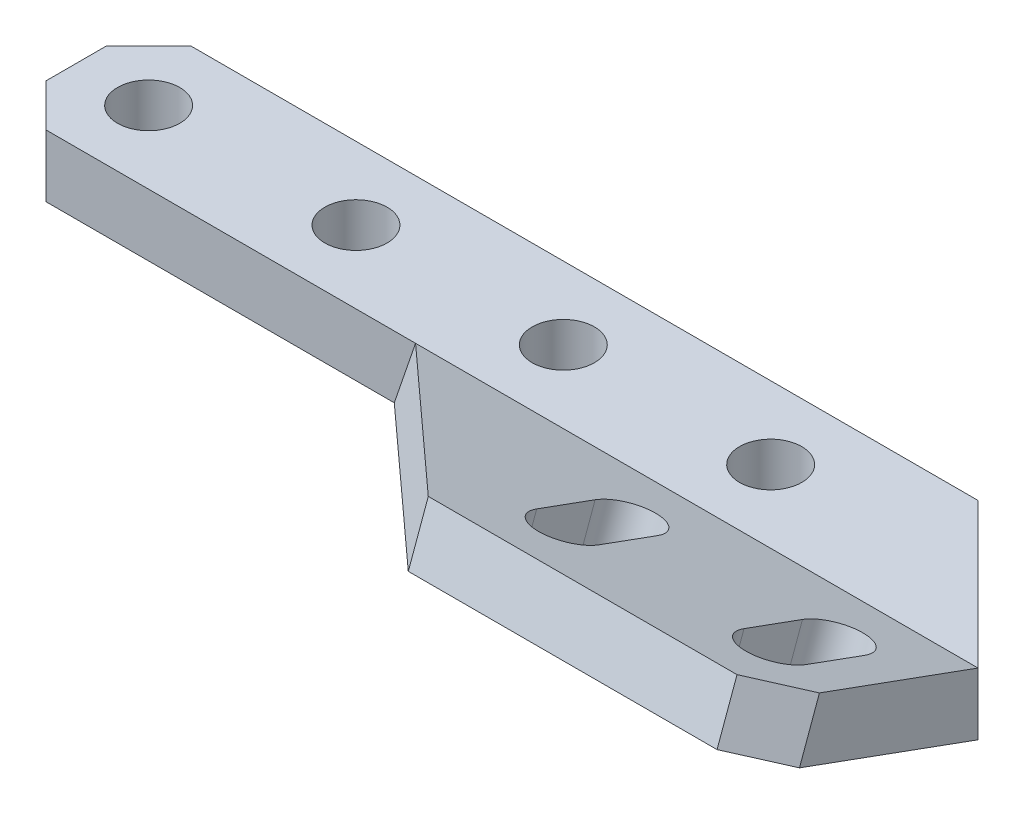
ISO-10303-21;
HEADER;
FILE_DESCRIPTION(('STEP AP214'),'2;1');
FILE_NAME('part.step','',(''),(''),'','','');
FILE_SCHEMA(('AUTOMOTIVE_DESIGN { 1 0 10303 214 1 1 1 1 }'));
ENDSEC;
DATA;
#1=APPLICATION_CONTEXT('core data for automotive mechanical design processes');
#2=APPLICATION_PROTOCOL_DEFINITION('international standard','automotive_design',2000,#1);
#3=PRODUCT_CONTEXT('',#1,'mechanical');
#4=PRODUCT('Part','Part','',(#3));
#5=PRODUCT_RELATED_PRODUCT_CATEGORY('part','',(#4));
#6=PRODUCT_DEFINITION_FORMATION('','',#4);
#7=PRODUCT_DEFINITION_CONTEXT('part definition',#1,'design');
#8=PRODUCT_DEFINITION('design','',#6,#7);
#9=PRODUCT_DEFINITION_SHAPE('','',#8);
#10=(LENGTH_UNIT() NAMED_UNIT(*) SI_UNIT(.MILLI.,.METRE.));
#11=(NAMED_UNIT(*) PLANE_ANGLE_UNIT() SI_UNIT($,.RADIAN.));
#12=(NAMED_UNIT(*) SI_UNIT($,.STERADIAN.) SOLID_ANGLE_UNIT());
#13=UNCERTAINTY_MEASURE_WITH_UNIT(LENGTH_MEASURE(1.E-05),#10,'distance_accuracy_value','');
#14=(GEOMETRIC_REPRESENTATION_CONTEXT(3) GLOBAL_UNCERTAINTY_ASSIGNED_CONTEXT((#13)) GLOBAL_UNIT_ASSIGNED_CONTEXT((#10,
#11,#12)) REPRESENTATION_CONTEXT('',''));
#15=CARTESIAN_POINT('',(0.,0.,0.));
#16=DIRECTION('',(0.,0.,1.));
#17=DIRECTION('',(1.,0.,0.));
#18=AXIS2_PLACEMENT_3D('',#15,#16,#17);
#19=CARTESIAN_POINT('',(13.5,2.64906666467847,2.53581858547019));
#20=DIRECTION('',(-1.,0.,0.));
#21=DIRECTION('',(0.,1.,0.));
#22=AXIS2_PLACEMENT_3D('',#19,#20,#21);
#23=PLANE('',#22);
#24=DIRECTION('',(0.,1.,0.));
#25=VECTOR('',#24,1.);
#26=CARTESIAN_POINT('',(13.5,2.64906666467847,3.5));
#27=LINE('',#26,#25);
#28=CARTESIAN_POINT('',(13.5,0.,3.5));
#29=VERTEX_POINT('',#28);
#30=CARTESIAN_POINT('',(13.5,3.,3.5));
#31=VERTEX_POINT('',#30);
#32=EDGE_CURVE('E189',#29,#31,#27,.T.);
#33=ORIENTED_EDGE('',*,*,#32,.T.);
#34=DIRECTION('',(0.,0.342020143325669,0.939692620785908));
#35=VECTOR('',#34,1.);
#36=CARTESIAN_POINT('',(13.5,2.64906666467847,2.53581858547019));
#37=LINE('',#36,#35);
#38=CARTESIAN_POINT('',(13.5,5.78282944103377,11.1457610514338));
#39=VERTEX_POINT('',#38);
#40=EDGE_CURVE('E264',#31,#39,#37,.T.);
#41=ORIENTED_EDGE('',*,*,#40,.T.);
#42=DIRECTION('',(0.,-0.939692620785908,0.342020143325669));
#43=VECTOR('',#42,1.);
#44=CARTESIAN_POINT('',(13.5,5.78282944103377,11.1457610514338));
#45=LINE('',#44,#43);
#46=CARTESIAN_POINT('',(13.5,3.1337627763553,12.1099424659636));
#47=VERTEX_POINT('',#46);
#48=EDGE_CURVE('E191',#39,#47,#45,.T.);
#49=ORIENTED_EDGE('',*,*,#48,.T.);
#50=DIRECTION('',(0.,0.342020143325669,0.939692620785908));
#51=VECTOR('',#50,1.);
#52=CARTESIAN_POINT('',(13.5,0.,3.5));
#53=LINE('',#52,#51);
#54=EDGE_CURVE('E181',#29,#47,#53,.T.);
#55=ORIENTED_EDGE('',*,*,#54,.F.);
#56=EDGE_LOOP('',(#33,#41,#49,#55));
#57=FACE_BOUND('',#56,.T.);
#58=ADVANCED_FACE('F35',(#57),#23,.F.);
#59=CARTESIAN_POINT('',(13.5,3.,3.5));
#60=DIRECTION('',(0.,0.,-1.));
#61=DIRECTION('',(1.,0.,0.));
#62=AXIS2_PLACEMENT_3D('',#59,#60,#61);
#63=PLANE('',#62);
#64=DIRECTION('',(0.323615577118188,0.946188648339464,0.));
#65=VECTOR('',#64,1.);
#66=CARTESIAN_POINT('',(-10.7857710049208,11.3062228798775,3.5));
#67=LINE('',#66,#65);
#68=CARTESIAN_POINT('',(-14.6527269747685,0.,3.5));
#69=VERTEX_POINT('',#68);
#70=CARTESIAN_POINT('',(-13.6266665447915,3.,3.5));
#71=VERTEX_POINT('',#70);
#72=EDGE_CURVE('E11',#69,#71,#67,.T.);
#73=ORIENTED_EDGE('',*,*,#72,.T.);
#74=DIRECTION('',(-1.,0.,0.));
#75=VECTOR('',#74,1.);
#76=CARTESIAN_POINT('',(13.5,3.,3.5));
#77=LINE('',#76,#75);
#78=CARTESIAN_POINT('',(-31.4497474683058,3.,3.5));
#79=VERTEX_POINT('',#78);
#80=EDGE_CURVE('E174',#71,#79,#77,.T.);
#81=ORIENTED_EDGE('',*,*,#80,.T.);
#82=DIRECTION('',(0.,-1.,0.));
#83=VECTOR('',#82,1.);
#84=CARTESIAN_POINT('',(-31.4497474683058,3.,3.5));
#85=LINE('',#84,#83);
#86=CARTESIAN_POINT('',(-31.4497474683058,0.,3.5));
#87=VERTEX_POINT('',#86);
#88=EDGE_CURVE('E43',#79,#87,#85,.T.);
#89=ORIENTED_EDGE('',*,*,#88,.T.);
#90=DIRECTION('',(-1.,0.,0.));
#91=VECTOR('',#90,1.);
#92=CARTESIAN_POINT('',(13.5,0.,3.5));
#93=LINE('',#92,#91);
#94=EDGE_CURVE('E184',#69,#87,#93,.T.);
#95=ORIENTED_EDGE('',*,*,#94,.F.);
#96=EDGE_LOOP('',(#73,#81,#89,#95));
#97=FACE_BOUND('',#96,.T.);
#98=ADVANCED_FACE('F37',(#97),#63,.F.);
#99=CARTESIAN_POINT('',(0.,3.,0.));
#100=DIRECTION('',(0.,1.,0.));
#101=DIRECTION('',(0.,0.,1.));
#102=AXIS2_PLACEMENT_3D('',#99,#100,#101);
#103=PLANE('',#102);
#104=CARTESIAN_POINT('',(-10.,3.,0.));
#105=DIRECTION('',(0.,-1.,0.));
#106=DIRECTION('',(0.,0.,1.));
#107=AXIS2_PLACEMENT_3D('',#104,#105,#106);
#108=CIRCLE('',#107,1.5);
#109=CARTESIAN_POINT('',(-10.,3.,1.5));
#110=VERTEX_POINT('',#109);
#111=EDGE_CURVE('E289',#110,#110,#108,.T.);
#112=ORIENTED_EDGE('',*,*,#111,.T.);
#113=EDGE_LOOP('',(#112));
#114=FACE_BOUND('',#113,.T.);
#115=CARTESIAN_POINT('',(-30.,3.,0.));
#116=DIRECTION('',(0.,-1.,0.));
#117=DIRECTION('',(0.,0.,1.));
#118=AXIS2_PLACEMENT_3D('',#115,#116,#117);
#119=CIRCLE('',#118,1.5);
#120=CARTESIAN_POINT('',(-30.,3.,1.5));
#121=VERTEX_POINT('',#120);
#122=EDGE_CURVE('E301',#121,#121,#119,.T.);
#123=ORIENTED_EDGE('',*,*,#122,.T.);
#124=EDGE_LOOP('',(#123));
#125=FACE_BOUND('',#124,.T.);
#126=EDGE_CURVE('E306',#31,#71,#77,.T.);
#127=ORIENTED_EDGE('',*,*,#126,.F.);
#128=DIRECTION('',(0.707106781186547,0.,0.707106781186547));
#129=VECTOR('',#128,1.);
#130=CARTESIAN_POINT('',(6.49999999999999,3.,-3.5));
#131=LINE('',#130,#129);
#132=CARTESIAN_POINT('',(6.49999999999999,3.,-3.5));
#133=VERTEX_POINT('',#132);
#134=EDGE_CURVE('E197',#133,#31,#131,.T.);
#135=ORIENTED_EDGE('',*,*,#134,.F.);
#136=DIRECTION('',(1.,0.,0.));
#137=VECTOR('',#136,1.);
#138=CARTESIAN_POINT('',(6.49999999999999,3.,-3.5));
#139=LINE('',#138,#137);
#140=CARTESIAN_POINT('',(-31.4497474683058,3.,-3.5));
#141=VERTEX_POINT('',#140);
#142=EDGE_CURVE('E317',#141,#133,#139,.T.);
#143=ORIENTED_EDGE('',*,*,#142,.F.);
#144=DIRECTION('',(0.707106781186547,0.,-0.707106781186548));
#145=VECTOR('',#144,1.);
#146=CARTESIAN_POINT('',(-33.5,3.,-1.44974746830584));
#147=LINE('',#146,#145);
#148=CARTESIAN_POINT('',(-33.5,3.,-1.44974746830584));
#149=VERTEX_POINT('',#148);
#150=EDGE_CURVE('E314',#149,#141,#147,.T.);
#151=ORIENTED_EDGE('',*,*,#150,.F.);
#152=DIRECTION('',(0.,0.,-1.));
#153=VECTOR('',#152,1.);
#154=CARTESIAN_POINT('',(-33.5,3.,1.44974746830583));
#155=LINE('',#154,#153);
#156=CARTESIAN_POINT('',(-33.5,3.,1.44974746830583));
#157=VERTEX_POINT('',#156);
#158=EDGE_CURVE('E311',#157,#149,#155,.T.);
#159=ORIENTED_EDGE('',*,*,#158,.F.);
#160=DIRECTION('',(-0.707106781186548,0.,-0.707106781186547));
#161=VECTOR('',#160,1.);
#162=CARTESIAN_POINT('',(-31.4497474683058,3.,3.5));
#163=LINE('',#162,#161);
#164=EDGE_CURVE('E308',#79,#157,#163,.T.);
#165=ORIENTED_EDGE('',*,*,#164,.F.);
#166=ORIENTED_EDGE('',*,*,#80,.F.);
#167=EDGE_LOOP('',(#127,#135,#143,#151,#159,#165,#166));
#168=FACE_BOUND('',#167,.T.);
#169=CARTESIAN_POINT('',(-20.,3.,0.));
#170=DIRECTION('',(0.,-1.,0.));
#171=DIRECTION('',(0.,0.,1.));
#172=AXIS2_PLACEMENT_3D('',#169,#170,#171);
#173=CIRCLE('',#172,1.5);
#174=CARTESIAN_POINT('',(-20.,3.,1.5));
#175=VERTEX_POINT('',#174);
#176=EDGE_CURVE('E295',#175,#175,#173,.T.);
#177=ORIENTED_EDGE('',*,*,#176,.T.);
#178=EDGE_LOOP('',(#177));
#179=FACE_BOUND('',#178,.T.);
#180=CARTESIAN_POINT('',(0.,3.,0.));
#181=DIRECTION('',(0.,-1.,0.));
#182=DIRECTION('',(0.,0.,1.));
#183=AXIS2_PLACEMENT_3D('',#180,#181,#182);
#184=CIRCLE('',#183,1.5);
#185=CARTESIAN_POINT('',(0.,3.,1.5));
#186=VERTEX_POINT('',#185);
#187=EDGE_CURVE('E283',#186,#186,#184,.T.);
#188=ORIENTED_EDGE('',*,*,#187,.T.);
#189=EDGE_LOOP('',(#188));
#190=FACE_BOUND('',#189,.T.);
#191=ADVANCED_FACE('F355',(#114,#125,#168,#179,#190),#103,.T.);
#192=CARTESIAN_POINT('',(0.,0.,0.));
#193=DIRECTION('',(0.,1.,0.));
#194=DIRECTION('',(0.,0.,1.));
#195=AXIS2_PLACEMENT_3D('',#192,#193,#194);
#196=PLANE('',#195);
#197=EDGE_CURVE('E167',#29,#69,#93,.T.);
#198=ORIENTED_EDGE('',*,*,#197,.T.);
#199=ORIENTED_EDGE('',*,*,#94,.T.);
#200=DIRECTION('',(-0.707106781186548,0.,-0.707106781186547));
#201=VECTOR('',#200,1.);
#202=CARTESIAN_POINT('',(-31.4497474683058,0.,3.5));
#203=LINE('',#202,#201);
#204=CARTESIAN_POINT('',(-33.5,0.,1.44974746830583));
#205=VERTEX_POINT('',#204);
#206=EDGE_CURVE('E183',#87,#205,#203,.T.);
#207=ORIENTED_EDGE('',*,*,#206,.T.);
#208=DIRECTION('',(0.,0.,-1.));
#209=VECTOR('',#208,1.);
#210=CARTESIAN_POINT('',(-33.5,0.,1.44974746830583));
#211=LINE('',#210,#209);
#212=CARTESIAN_POINT('',(-33.5,0.,-1.44974746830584));
#213=VERTEX_POINT('',#212);
#214=EDGE_CURVE('E324',#205,#213,#211,.T.);
#215=ORIENTED_EDGE('',*,*,#214,.T.);
#216=DIRECTION('',(0.707106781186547,0.,-0.707106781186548));
#217=VECTOR('',#216,1.);
#218=CARTESIAN_POINT('',(-33.5,0.,-1.44974746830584));
#219=LINE('',#218,#217);
#220=CARTESIAN_POINT('',(-31.4497474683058,0.,-3.5));
#221=VERTEX_POINT('',#220);
#222=EDGE_CURVE('E327',#213,#221,#219,.T.);
#223=ORIENTED_EDGE('',*,*,#222,.T.);
#224=DIRECTION('',(1.,0.,0.));
#225=VECTOR('',#224,1.);
#226=CARTESIAN_POINT('',(6.49999999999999,0.,-3.5));
#227=LINE('',#226,#225);
#228=CARTESIAN_POINT('',(6.49999999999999,0.,-3.5));
#229=VERTEX_POINT('',#228);
#230=EDGE_CURVE('E171',#221,#229,#227,.T.);
#231=ORIENTED_EDGE('',*,*,#230,.T.);
#232=DIRECTION('',(0.707106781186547,0.,0.707106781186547));
#233=VECTOR('',#232,1.);
#234=CARTESIAN_POINT('',(6.49999999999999,0.,-3.5));
#235=LINE('',#234,#233);
#236=EDGE_CURVE('E163',#229,#29,#235,.T.);
#237=ORIENTED_EDGE('',*,*,#236,.T.);
#238=EDGE_LOOP('',(#198,#199,#207,#215,#223,#231,#237));
#239=FACE_BOUND('',#238,.T.);
#240=CARTESIAN_POINT('',(-30.,0.,0.));
#241=DIRECTION('',(0.,-1.,0.));
#242=DIRECTION('',(0.,0.,1.));
#243=AXIS2_PLACEMENT_3D('',#240,#241,#242);
#244=CIRCLE('',#243,1.5);
#245=CARTESIAN_POINT('',(-30.,0.,1.5));
#246=VERTEX_POINT('',#245);
#247=EDGE_CURVE('E298',#246,#246,#244,.T.);
#248=ORIENTED_EDGE('',*,*,#247,.F.);
#249=EDGE_LOOP('',(#248));
#250=FACE_BOUND('',#249,.T.);
#251=CARTESIAN_POINT('',(-20.,0.,0.));
#252=DIRECTION('',(0.,-1.,0.));
#253=DIRECTION('',(0.,0.,1.));
#254=AXIS2_PLACEMENT_3D('',#251,#252,#253);
#255=CIRCLE('',#254,1.5);
#256=CARTESIAN_POINT('',(-20.,0.,1.5));
#257=VERTEX_POINT('',#256);
#258=EDGE_CURVE('E292',#257,#257,#255,.T.);
#259=ORIENTED_EDGE('',*,*,#258,.F.);
#260=EDGE_LOOP('',(#259));
#261=FACE_BOUND('',#260,.T.);
#262=CARTESIAN_POINT('',(-10.,0.,0.));
#263=DIRECTION('',(0.,-1.,0.));
#264=DIRECTION('',(0.,0.,1.));
#265=AXIS2_PLACEMENT_3D('',#262,#263,#264);
#266=CIRCLE('',#265,1.5);
#267=CARTESIAN_POINT('',(-10.,0.,1.5));
#268=VERTEX_POINT('',#267);
#269=EDGE_CURVE('E286',#268,#268,#266,.T.);
#270=ORIENTED_EDGE('',*,*,#269,.F.);
#271=EDGE_LOOP('',(#270));
#272=FACE_BOUND('',#271,.T.);
#273=CARTESIAN_POINT('',(0.,0.,0.));
#274=DIRECTION('',(0.,-1.,0.));
#275=DIRECTION('',(0.,0.,1.));
#276=AXIS2_PLACEMENT_3D('',#273,#274,#275);
#277=CIRCLE('',#276,1.5);
#278=CARTESIAN_POINT('',(0.,0.,1.5));
#279=VERTEX_POINT('',#278);
#280=EDGE_CURVE('E282',#279,#279,#277,.T.);
#281=ORIENTED_EDGE('',*,*,#280,.F.);
#282=EDGE_LOOP('',(#281));
#283=FACE_BOUND('',#282,.T.);
#284=ADVANCED_FACE('F164',(#239,#250,#261,#272,#283),#196,.F.);
#285=CARTESIAN_POINT('',(-31.4497474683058,3.,3.5));
#286=DIRECTION('',(0.707106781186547,0.,-0.707106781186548));
#287=DIRECTION('',(0.707106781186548,0.,0.707106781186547));
#288=AXIS2_PLACEMENT_3D('',#285,#286,#287);
#289=PLANE('',#288);
#290=ORIENTED_EDGE('',*,*,#206,.F.);
#291=ORIENTED_EDGE('',*,*,#88,.F.);
#292=ORIENTED_EDGE('',*,*,#164,.T.);
#293=DIRECTION('',(0.,-1.,0.));
#294=VECTOR('',#293,1.);
#295=CARTESIAN_POINT('',(-33.5,3.,1.44974746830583));
#296=LINE('',#295,#294);
#297=EDGE_CURVE('E335',#157,#205,#296,.T.);
#298=ORIENTED_EDGE('',*,*,#297,.T.);
#299=EDGE_LOOP('',(#290,#291,#292,#298));
#300=FACE_BOUND('',#299,.T.);
#301=ADVANCED_FACE('F342',(#300),#289,.F.);
#302=CARTESIAN_POINT('',(-33.5,3.,1.44974746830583));
#303=DIRECTION('',(1.,0.,0.));
#304=DIRECTION('',(0.,0.,1.));
#305=AXIS2_PLACEMENT_3D('',#302,#303,#304);
#306=PLANE('',#305);
#307=ORIENTED_EDGE('',*,*,#214,.F.);
#308=ORIENTED_EDGE('',*,*,#297,.F.);
#309=ORIENTED_EDGE('',*,*,#158,.T.);
#310=DIRECTION('',(0.,-1.,0.));
#311=VECTOR('',#310,1.);
#312=CARTESIAN_POINT('',(-33.5,3.,-1.44974746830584));
#313=LINE('',#312,#311);
#314=EDGE_CURVE('E333',#149,#213,#313,.T.);
#315=ORIENTED_EDGE('',*,*,#314,.T.);
#316=EDGE_LOOP('',(#307,#308,#309,#315));
#317=FACE_BOUND('',#316,.T.);
#318=ADVANCED_FACE('F347',(#317),#306,.F.);
#319=CARTESIAN_POINT('',(-33.5,3.,-1.44974746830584));
#320=DIRECTION('',(0.707106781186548,0.,0.707106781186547));
#321=DIRECTION('',(-0.707106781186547,0.,0.707106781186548));
#322=AXIS2_PLACEMENT_3D('',#319,#320,#321);
#323=PLANE('',#322);
#324=ORIENTED_EDGE('',*,*,#222,.F.);
#325=ORIENTED_EDGE('',*,*,#314,.F.);
#326=ORIENTED_EDGE('',*,*,#150,.T.);
#327=DIRECTION('',(0.,-1.,0.));
#328=VECTOR('',#327,1.);
#329=CARTESIAN_POINT('',(-31.4497474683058,3.,-3.5));
#330=LINE('',#329,#328);
#331=EDGE_CURVE('E331',#141,#221,#330,.T.);
#332=ORIENTED_EDGE('',*,*,#331,.T.);
#333=EDGE_LOOP('',(#324,#325,#326,#332));
#334=FACE_BOUND('',#333,.T.);
#335=ADVANCED_FACE('F350',(#334),#323,.F.);
#336=CARTESIAN_POINT('',(6.49999999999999,3.,-3.5));
#337=DIRECTION('',(0.,0.,1.));
#338=DIRECTION('',(-1.,0.,0.));
#339=AXIS2_PLACEMENT_3D('',#336,#337,#338);
#340=PLANE('',#339);
#341=ORIENTED_EDGE('',*,*,#230,.F.);
#342=ORIENTED_EDGE('',*,*,#331,.F.);
#343=ORIENTED_EDGE('',*,*,#142,.T.);
#344=DIRECTION('',(0.,-1.,0.));
#345=VECTOR('',#344,1.);
#346=CARTESIAN_POINT('',(6.49999999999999,3.,-3.5));
#347=LINE('',#346,#345);
#348=EDGE_CURVE('E320',#133,#229,#347,.T.);
#349=ORIENTED_EDGE('',*,*,#348,.T.);
#350=EDGE_LOOP('',(#341,#342,#343,#349));
#351=FACE_BOUND('',#350,.T.);
#352=ADVANCED_FACE('F353',(#351),#340,.F.);
#353=CARTESIAN_POINT('',(6.49999999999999,3.,-3.5));
#354=DIRECTION('',(-0.707106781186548,0.,0.707106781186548));
#355=DIRECTION('',(-0.707106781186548,0.,-0.707106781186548));
#356=AXIS2_PLACEMENT_3D('',#353,#354,#355);
#357=PLANE('',#356);
#358=ORIENTED_EDGE('',*,*,#32,.F.);
#359=ORIENTED_EDGE('',*,*,#236,.F.);
#360=ORIENTED_EDGE('',*,*,#348,.F.);
#361=ORIENTED_EDGE('',*,*,#134,.T.);
#362=EDGE_LOOP('',(#358,#359,#360,#361));
#363=FACE_BOUND('',#362,.T.);
#364=ADVANCED_FACE('F195',(#363),#357,.F.);
#365=CARTESIAN_POINT('',(-30.,3.,0.));
#366=DIRECTION('',(0.,-1.,0.));
#367=DIRECTION('',(0.,0.,-1.));
#368=AXIS2_PLACEMENT_3D('',#365,#366,#367);
#369=CYLINDRICAL_SURFACE('',#368,1.5);
#370=ORIENTED_EDGE('',*,*,#122,.F.);
#371=EDGE_LOOP('',(#370));
#372=FACE_BOUND('',#371,.T.);
#373=ORIENTED_EDGE('',*,*,#247,.T.);
#374=EDGE_LOOP('',(#373));
#375=FACE_BOUND('',#374,.T.);
#376=ADVANCED_FACE('F394',(#372,#375),#369,.F.);
#377=CARTESIAN_POINT('',(-20.,3.,0.));
#378=DIRECTION('',(0.,-1.,0.));
#379=DIRECTION('',(0.,0.,-1.));
#380=AXIS2_PLACEMENT_3D('',#377,#378,#379);
#381=CYLINDRICAL_SURFACE('',#380,1.5);
#382=ORIENTED_EDGE('',*,*,#176,.F.);
#383=EDGE_LOOP('',(#382));
#384=FACE_BOUND('',#383,.T.);
#385=ORIENTED_EDGE('',*,*,#258,.T.);
#386=EDGE_LOOP('',(#385));
#387=FACE_BOUND('',#386,.T.);
#388=ADVANCED_FACE('F390',(#384,#387),#381,.F.);
#389=CARTESIAN_POINT('',(-10.,3.,0.));
#390=DIRECTION('',(0.,-1.,0.));
#391=DIRECTION('',(0.,0.,-1.));
#392=AXIS2_PLACEMENT_3D('',#389,#390,#391);
#393=CYLINDRICAL_SURFACE('',#392,1.5);
#394=ORIENTED_EDGE('',*,*,#111,.F.);
#395=EDGE_LOOP('',(#394));
#396=FACE_BOUND('',#395,.T.);
#397=ORIENTED_EDGE('',*,*,#269,.T.);
#398=EDGE_LOOP('',(#397));
#399=FACE_BOUND('',#398,.T.);
#400=ADVANCED_FACE('F376',(#396,#399),#393,.F.);
#401=CARTESIAN_POINT('',(0.,3.,0.));
#402=DIRECTION('',(0.,-1.,0.));
#403=DIRECTION('',(0.,0.,-1.));
#404=AXIS2_PLACEMENT_3D('',#401,#402,#403);
#405=CYLINDRICAL_SURFACE('',#404,1.5);
#406=ORIENTED_EDGE('',*,*,#187,.F.);
#407=EDGE_LOOP('',(#406));
#408=FACE_BOUND('',#407,.T.);
#409=ORIENTED_EDGE('',*,*,#280,.T.);
#410=EDGE_LOOP('',(#409));
#411=FACE_BOUND('',#410,.T.);
#412=ADVANCED_FACE('F368',(#408,#411),#405,.F.);
#413=CARTESIAN_POINT('',(-14.6527269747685,2.64906666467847,2.53581858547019));
#414=DIRECTION('',(0.707106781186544,-0.241844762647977,-0.664463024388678));
#415=DIRECTION('',(0.68479107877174,0.,0.728739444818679));
#416=AXIS2_PLACEMENT_3D('',#413,#414,#415);
#417=PLANE('',#416);
#418=DIRECTION('',(-0.707106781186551,-0.241844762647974,-0.664463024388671));
#419=VECTOR('',#418,1.);
#420=CARTESIAN_POINT('',(-14.6527269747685,0.,3.5));
#421=LINE('',#420,#419);
#422=CARTESIAN_POINT('',(-3.43996504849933,3.83499044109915,14.0365496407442));
#423=VERTEX_POINT('',#422);
#424=EDGE_CURVE('E58',#423,#69,#421,.T.);
#425=ORIENTED_EDGE('',*,*,#424,.F.);
#426=DIRECTION('',(0.,-0.939692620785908,0.342020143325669));
#427=VECTOR('',#426,1.);
#428=CARTESIAN_POINT('',(-3.43996504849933,6.48405710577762,13.0723682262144));
#429=LINE('',#428,#427);
#430=CARTESIAN_POINT('',(-3.43996504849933,6.48405710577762,13.0723682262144));
#431=VERTEX_POINT('',#430);
#432=EDGE_CURVE('E271',#431,#423,#429,.T.);
#433=ORIENTED_EDGE('',*,*,#432,.F.);
#434=DIRECTION('',(-0.707106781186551,-0.241844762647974,-0.664463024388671));
#435=VECTOR('',#434,1.);
#436=CARTESIAN_POINT('',(-14.6527269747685,2.64906666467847,2.53581858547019));
#437=LINE('',#436,#435);
#438=EDGE_CURVE('E50',#431,#71,#437,.T.);
#439=ORIENTED_EDGE('',*,*,#438,.T.);
#440=ORIENTED_EDGE('',*,*,#72,.F.);
#441=EDGE_LOOP('',(#425,#433,#439,#440));
#442=FACE_BOUND('',#441,.T.);
#443=ADVANCED_FACE('F366',(#442),#417,.F.);
#444=CARTESIAN_POINT('',(0.,1.52418834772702,-0.554759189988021));
#445=DIRECTION('',(0.,0.939692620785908,-0.342020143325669));
#446=DIRECTION('',(0.,0.342020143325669,0.939692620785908));
#447=AXIS2_PLACEMENT_3D('',#444,#445,#446);
#448=PLANE('',#447);
#449=DIRECTION('',(0.,0.342020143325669,0.939692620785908));
#450=VECTOR('',#449,1.);
#451=CARTESIAN_POINT('',(11.5,4.26092617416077,6.96436619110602));
#452=LINE('',#451,#450);
#453=CARTESIAN_POINT('',(11.5,4.26092617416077,6.96436619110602));
#454=VERTEX_POINT('',#453);
#455=CARTESIAN_POINT('',(11.5,5.28698660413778,9.78344405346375));
#456=VERTEX_POINT('',#455);
#457=EDGE_CURVE('E208',#454,#456,#452,.T.);
#458=ORIENTED_EDGE('',*,*,#457,.T.);
#459=CARTESIAN_POINT('',(10.,5.28698660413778,9.78344405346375));
#460=DIRECTION('',(0.,-0.939692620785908,0.342020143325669));
#461=DIRECTION('',(0.,0.342020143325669,0.939692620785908));
#462=AXIS2_PLACEMENT_3D('',#459,#460,#461);
#463=CIRCLE('',#462,1.5);
#464=CARTESIAN_POINT('',(8.5,5.28698660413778,9.78344405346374));
#465=VERTEX_POINT('',#464);
#466=EDGE_CURVE('E212',#456,#465,#463,.T.);
#467=ORIENTED_EDGE('',*,*,#466,.T.);
#468=DIRECTION('',(0.,-0.342020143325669,-0.939692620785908));
#469=VECTOR('',#468,1.);
#470=CARTESIAN_POINT('',(8.5,4.26092617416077,6.96436619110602));
#471=LINE('',#470,#469);
#472=CARTESIAN_POINT('',(8.5,4.26092617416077,6.96436619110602));
#473=VERTEX_POINT('',#472);
#474=EDGE_CURVE('E215',#465,#473,#471,.T.);
#475=ORIENTED_EDGE('',*,*,#474,.T.);
#476=CARTESIAN_POINT('',(10.,4.26092617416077,6.96436619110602));
#477=DIRECTION('',(0.,-0.939692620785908,0.342020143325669));
#478=DIRECTION('',(0.,0.342020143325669,0.939692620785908));
#479=AXIS2_PLACEMENT_3D('',#476,#477,#478);
#480=CIRCLE('',#479,1.5);
#481=EDGE_CURVE('E205',#473,#454,#480,.T.);
#482=ORIENTED_EDGE('',*,*,#481,.T.);
#483=EDGE_LOOP('',(#458,#467,#475,#482));
#484=FACE_BOUND('',#483,.T.);
#485=DIRECTION('',(0.,0.342020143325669,0.939692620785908));
#486=VECTOR('',#485,1.);
#487=CARTESIAN_POINT('',(1.5,4.26092617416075,6.96436619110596));
#488=LINE('',#487,#486);
#489=CARTESIAN_POINT('',(1.5,4.26092617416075,6.96436619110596));
#490=VERTEX_POINT('',#489);
#491=CARTESIAN_POINT('',(1.5,5.28698660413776,9.78344405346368));
#492=VERTEX_POINT('',#491);
#493=EDGE_CURVE('E237',#490,#492,#488,.T.);
#494=ORIENTED_EDGE('',*,*,#493,.T.);
#495=CARTESIAN_POINT('',(0.,5.28698660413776,9.78344405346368));
#496=DIRECTION('',(0.,-0.939692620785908,0.342020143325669));
#497=DIRECTION('',(0.,0.342020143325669,0.939692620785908));
#498=AXIS2_PLACEMENT_3D('',#495,#496,#497);
#499=CIRCLE('',#498,1.5);
#500=CARTESIAN_POINT('',(-1.5,5.28698660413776,9.78344405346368));
#501=VERTEX_POINT('',#500);
#502=EDGE_CURVE('E241',#492,#501,#499,.T.);
#503=ORIENTED_EDGE('',*,*,#502,.T.);
#504=DIRECTION('',(0.,-0.342020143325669,-0.939692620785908));
#505=VECTOR('',#504,1.);
#506=CARTESIAN_POINT('',(-1.5,4.26092617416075,6.96436619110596));
#507=LINE('',#506,#505);
#508=CARTESIAN_POINT('',(-1.5,4.26092617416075,6.96436619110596));
#509=VERTEX_POINT('',#508);
#510=EDGE_CURVE('E244',#501,#509,#507,.T.);
#511=ORIENTED_EDGE('',*,*,#510,.T.);
#512=CARTESIAN_POINT('',(0.,4.26092617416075,6.96436619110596));
#513=DIRECTION('',(0.,-0.939692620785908,0.342020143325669));
#514=DIRECTION('',(0.,0.342020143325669,0.939692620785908));
#515=AXIS2_PLACEMENT_3D('',#512,#513,#514);
#516=CIRCLE('',#515,1.5);
#517=EDGE_CURVE('E234',#509,#490,#516,.T.);
#518=ORIENTED_EDGE('',*,*,#517,.T.);
#519=EDGE_LOOP('',(#494,#503,#511,#518));
#520=FACE_BOUND('',#519,.T.);
#521=ORIENTED_EDGE('',*,*,#126,.T.);
#522=ORIENTED_EDGE('',*,*,#438,.F.);
#523=DIRECTION('',(-1.,0.,0.));
#524=VECTOR('',#523,1.);
#525=CARTESIAN_POINT('',(11.4497474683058,6.48405710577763,13.0723682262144));
#526=LINE('',#525,#524);
#527=CARTESIAN_POINT('',(11.4497474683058,6.48405710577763,13.0723682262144));
#528=VERTEX_POINT('',#527);
#529=EDGE_CURVE('E269',#528,#431,#526,.T.);
#530=ORIENTED_EDGE('',*,*,#529,.F.);
#531=DIRECTION('',(-0.707106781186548,0.241844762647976,0.664463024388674));
#532=VECTOR('',#531,1.);
#533=CARTESIAN_POINT('',(13.5,5.78282944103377,11.1457610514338));
#534=LINE('',#533,#532);
#535=EDGE_CURVE('E266',#39,#528,#534,.T.);
#536=ORIENTED_EDGE('',*,*,#535,.F.);
#537=ORIENTED_EDGE('',*,*,#40,.F.);
#538=EDGE_LOOP('',(#521,#522,#530,#536,#537));
#539=FACE_BOUND('',#538,.T.);
#540=ADVANCED_FACE('F359',(#484,#520,#539),#448,.T.);
#541=CARTESIAN_POINT('',(0.,-1.12487831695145,0.40942222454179));
#542=DIRECTION('',(0.,0.939692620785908,-0.342020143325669));
#543=DIRECTION('',(0.,0.342020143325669,0.939692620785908));
#544=AXIS2_PLACEMENT_3D('',#541,#542,#543);
#545=PLANE('',#544);
#546=CARTESIAN_POINT('',(0.,1.61185950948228,7.92854760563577));
#547=DIRECTION('',(0.,-0.939692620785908,0.342020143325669));
#548=DIRECTION('',(0.,0.342020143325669,0.939692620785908));
#549=AXIS2_PLACEMENT_3D('',#546,#547,#548);
#550=CIRCLE('',#549,1.5);
#551=CARTESIAN_POINT('',(-1.5,1.61185950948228,7.92854760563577));
#552=VERTEX_POINT('',#551);
#553=CARTESIAN_POINT('',(1.5,1.61185950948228,7.92854760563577));
#554=VERTEX_POINT('',#553);
#555=EDGE_CURVE('E233',#552,#554,#550,.T.);
#556=ORIENTED_EDGE('',*,*,#555,.F.);
#557=DIRECTION('',(0.,-0.342020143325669,-0.939692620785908));
#558=VECTOR('',#557,1.);
#559=CARTESIAN_POINT('',(-1.5,1.61185950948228,7.92854760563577));
#560=LINE('',#559,#558);
#561=CARTESIAN_POINT('',(-1.5,2.63791993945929,10.7476254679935));
#562=VERTEX_POINT('',#561);
#563=EDGE_CURVE('E238',#562,#552,#560,.T.);
#564=ORIENTED_EDGE('',*,*,#563,.F.);
#565=CARTESIAN_POINT('',(0.,2.63791993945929,10.7476254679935));
#566=DIRECTION('',(0.,-0.939692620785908,0.342020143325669));
#567=DIRECTION('',(0.,0.342020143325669,0.939692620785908));
#568=AXIS2_PLACEMENT_3D('',#565,#566,#567);
#569=CIRCLE('',#568,1.5);
#570=CARTESIAN_POINT('',(1.5,2.63791993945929,10.7476254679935));
#571=VERTEX_POINT('',#570);
#572=EDGE_CURVE('E253',#571,#562,#569,.T.);
#573=ORIENTED_EDGE('',*,*,#572,.F.);
#574=DIRECTION('',(0.,0.342020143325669,0.939692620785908));
#575=VECTOR('',#574,1.);
#576=CARTESIAN_POINT('',(1.5,1.61185950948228,7.92854760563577));
#577=LINE('',#576,#575);
#578=EDGE_CURVE('E250',#554,#571,#577,.T.);
#579=ORIENTED_EDGE('',*,*,#578,.F.);
#580=EDGE_LOOP('',(#556,#564,#573,#579));
#581=FACE_BOUND('',#580,.T.);
#582=ORIENTED_EDGE('',*,*,#54,.T.);
#583=DIRECTION('',(-0.707106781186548,0.241844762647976,0.664463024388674));
#584=VECTOR('',#583,1.);
#585=CARTESIAN_POINT('',(13.5,3.1337627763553,12.1099424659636));
#586=LINE('',#585,#584);
#587=CARTESIAN_POINT('',(11.4497474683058,3.83499044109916,14.0365496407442));
#588=VERTEX_POINT('',#587);
#589=EDGE_CURVE('E192',#47,#588,#586,.T.);
#590=ORIENTED_EDGE('',*,*,#589,.T.);
#591=DIRECTION('',(-1.,0.,0.));
#592=VECTOR('',#591,1.);
#593=CARTESIAN_POINT('',(11.4497474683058,3.83499044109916,14.0365496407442));
#594=LINE('',#593,#592);
#595=EDGE_CURVE('E274',#588,#423,#594,.T.);
#596=ORIENTED_EDGE('',*,*,#595,.T.);
#597=ORIENTED_EDGE('',*,*,#424,.T.);
#598=ORIENTED_EDGE('',*,*,#197,.F.);
#599=EDGE_LOOP('',(#582,#590,#596,#597,#598));
#600=FACE_BOUND('',#599,.T.);
#601=CARTESIAN_POINT('',(10.,1.61185950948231,7.92854760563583));
#602=DIRECTION('',(0.,-0.939692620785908,0.342020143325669));
#603=DIRECTION('',(0.,0.342020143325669,0.939692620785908));
#604=AXIS2_PLACEMENT_3D('',#601,#602,#603);
#605=CIRCLE('',#604,1.5);
#606=CARTESIAN_POINT('',(8.5,1.61185950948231,7.92854760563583));
#607=VERTEX_POINT('',#606);
#608=CARTESIAN_POINT('',(11.5,1.61185950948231,7.92854760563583));
#609=VERTEX_POINT('',#608);
#610=EDGE_CURVE('E199',#607,#609,#605,.T.);
#611=ORIENTED_EDGE('',*,*,#610,.F.);
#612=DIRECTION('',(0.,-0.342020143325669,-0.939692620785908));
#613=VECTOR('',#612,1.);
#614=CARTESIAN_POINT('',(8.5,1.61185950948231,7.92854760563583));
#615=LINE('',#614,#613);
#616=CARTESIAN_POINT('',(8.5,2.63791993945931,10.7476254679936));
#617=VERTEX_POINT('',#616);
#618=EDGE_CURVE('E209',#617,#607,#615,.T.);
#619=ORIENTED_EDGE('',*,*,#618,.F.);
#620=CARTESIAN_POINT('',(10.,2.63791993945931,10.7476254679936));
#621=DIRECTION('',(0.,-0.939692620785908,0.342020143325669));
#622=DIRECTION('',(0.,0.342020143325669,0.939692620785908));
#623=AXIS2_PLACEMENT_3D('',#620,#621,#622);
#624=CIRCLE('',#623,1.5);
#625=CARTESIAN_POINT('',(11.5,2.63791993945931,10.7476254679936));
#626=VERTEX_POINT('',#625);
#627=EDGE_CURVE('E221',#626,#617,#624,.T.);
#628=ORIENTED_EDGE('',*,*,#627,.F.);
#629=DIRECTION('',(0.,0.342020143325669,0.939692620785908));
#630=VECTOR('',#629,1.);
#631=CARTESIAN_POINT('',(11.5,1.61185950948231,7.92854760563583));
#632=LINE('',#631,#630);
#633=EDGE_CURVE('E202',#609,#626,#632,.T.);
#634=ORIENTED_EDGE('',*,*,#633,.F.);
#635=EDGE_LOOP('',(#611,#619,#628,#634));
#636=FACE_BOUND('',#635,.T.);
#637=ADVANCED_FACE('F178',(#581,#600,#636),#545,.F.);
#638=CARTESIAN_POINT('',(13.5,5.78282944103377,11.1457610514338));
#639=DIRECTION('',(-0.707106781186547,-0.241844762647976,-0.664463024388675));
#640=DIRECTION('',(0.684791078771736,0.,-0.728739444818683));
#641=AXIS2_PLACEMENT_3D('',#638,#639,#640);
#642=PLANE('',#641);
#643=ORIENTED_EDGE('',*,*,#589,.F.);
#644=ORIENTED_EDGE('',*,*,#48,.F.);
#645=ORIENTED_EDGE('',*,*,#535,.T.);
#646=DIRECTION('',(0.,-0.939692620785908,0.342020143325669));
#647=VECTOR('',#646,1.);
#648=CARTESIAN_POINT('',(11.4497474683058,6.48405710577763,13.0723682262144));
#649=LINE('',#648,#647);
#650=EDGE_CURVE('E279',#528,#588,#649,.T.);
#651=ORIENTED_EDGE('',*,*,#650,.T.);
#652=EDGE_LOOP('',(#643,#644,#645,#651));
#653=FACE_BOUND('',#652,.T.);
#654=ADVANCED_FACE('F362',(#653),#642,.F.);
#655=CARTESIAN_POINT('',(11.4497474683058,6.48405710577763,13.0723682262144));
#656=DIRECTION('',(0.,-0.342020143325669,-0.939692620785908));
#657=DIRECTION('',(0.,0.939692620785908,-0.342020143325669));
#658=AXIS2_PLACEMENT_3D('',#655,#656,#657);
#659=PLANE('',#658);
#660=ORIENTED_EDGE('',*,*,#595,.F.);
#661=ORIENTED_EDGE('',*,*,#650,.F.);
#662=ORIENTED_EDGE('',*,*,#529,.T.);
#663=ORIENTED_EDGE('',*,*,#432,.T.);
#664=EDGE_LOOP('',(#660,#661,#662,#663));
#665=FACE_BOUND('',#664,.T.);
#666=ADVANCED_FACE('F365',(#665),#659,.F.);
#667=CARTESIAN_POINT('',(0.,4.26092617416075,6.96436619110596));
#668=DIRECTION('',(0.,-0.939692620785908,0.342020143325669));
#669=DIRECTION('',(0.,-0.342020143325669,-0.939692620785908));
#670=AXIS2_PLACEMENT_3D('',#667,#668,#669);
#671=CYLINDRICAL_SURFACE('',#670,1.5);
#672=ORIENTED_EDGE('',*,*,#555,.T.);
#673=DIRECTION('',(0.,-0.939692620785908,0.342020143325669));
#674=VECTOR('',#673,1.);
#675=CARTESIAN_POINT('',(1.5,4.26092617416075,6.96436619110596));
#676=LINE('',#675,#674);
#677=EDGE_CURVE('E193',#490,#554,#676,.T.);
#678=ORIENTED_EDGE('',*,*,#677,.F.);
#679=ORIENTED_EDGE('',*,*,#517,.F.);
#680=DIRECTION('',(0.,-0.939692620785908,0.342020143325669));
#681=VECTOR('',#680,1.);
#682=CARTESIAN_POINT('',(-1.5,4.26092617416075,6.96436619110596));
#683=LINE('',#682,#681);
#684=EDGE_CURVE('E247',#509,#552,#683,.T.);
#685=ORIENTED_EDGE('',*,*,#684,.T.);
#686=EDGE_LOOP('',(#672,#678,#679,#685));
#687=FACE_BOUND('',#686,.T.);
#688=ADVANCED_FACE('F482',(#687),#671,.F.);
#689=CARTESIAN_POINT('',(1.5,4.26092617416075,6.96436619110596));
#690=DIRECTION('',(-1.,0.,0.));
#691=DIRECTION('',(0.,1.,0.));
#692=AXIS2_PLACEMENT_3D('',#689,#690,#691);
#693=PLANE('',#692);
#694=ORIENTED_EDGE('',*,*,#578,.T.);
#695=DIRECTION('',(0.,-0.939692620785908,0.342020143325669));
#696=VECTOR('',#695,1.);
#697=CARTESIAN_POINT('',(1.5,5.28698660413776,9.78344405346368));
#698=LINE('',#697,#696);
#699=EDGE_CURVE('E261',#492,#571,#698,.T.);
#700=ORIENTED_EDGE('',*,*,#699,.F.);
#701=ORIENTED_EDGE('',*,*,#493,.F.);
#702=ORIENTED_EDGE('',*,*,#677,.T.);
#703=EDGE_LOOP('',(#694,#700,#701,#702));
#704=FACE_BOUND('',#703,.T.);
#705=ADVANCED_FACE('F490',(#704),#693,.T.);
#706=CARTESIAN_POINT('',(0.,5.28698660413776,9.78344405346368));
#707=DIRECTION('',(0.,-0.939692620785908,0.342020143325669));
#708=DIRECTION('',(0.,-0.342020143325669,-0.939692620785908));
#709=AXIS2_PLACEMENT_3D('',#706,#707,#708);
#710=CYLINDRICAL_SURFACE('',#709,1.5);
#711=ORIENTED_EDGE('',*,*,#572,.T.);
#712=DIRECTION('',(0.,-0.939692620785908,0.342020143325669));
#713=VECTOR('',#712,1.);
#714=CARTESIAN_POINT('',(-1.5,5.28698660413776,9.78344405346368));
#715=LINE('',#714,#713);
#716=EDGE_CURVE('E259',#501,#562,#715,.T.);
#717=ORIENTED_EDGE('',*,*,#716,.F.);
#718=ORIENTED_EDGE('',*,*,#502,.F.);
#719=ORIENTED_EDGE('',*,*,#699,.T.);
#720=EDGE_LOOP('',(#711,#717,#718,#719));
#721=FACE_BOUND('',#720,.T.);
#722=ADVANCED_FACE('F500',(#721),#710,.F.);
#723=CARTESIAN_POINT('',(-1.5,4.26092617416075,6.96436619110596));
#724=DIRECTION('',(1.,0.,0.));
#725=DIRECTION('',(0.,-1.,0.));
#726=AXIS2_PLACEMENT_3D('',#723,#724,#725);
#727=PLANE('',#726);
#728=ORIENTED_EDGE('',*,*,#563,.T.);
#729=ORIENTED_EDGE('',*,*,#684,.F.);
#730=ORIENTED_EDGE('',*,*,#510,.F.);
#731=ORIENTED_EDGE('',*,*,#716,.T.);
#732=EDGE_LOOP('',(#728,#729,#730,#731));
#733=FACE_BOUND('',#732,.T.);
#734=ADVANCED_FACE('F510',(#733),#727,.T.);
#735=CARTESIAN_POINT('',(10.,4.26092617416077,6.96436619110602));
#736=DIRECTION('',(0.,-0.939692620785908,0.342020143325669));
#737=DIRECTION('',(0.,-0.342020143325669,-0.939692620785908));
#738=AXIS2_PLACEMENT_3D('',#735,#736,#737);
#739=CYLINDRICAL_SURFACE('',#738,1.5);
#740=ORIENTED_EDGE('',*,*,#610,.T.);
#741=DIRECTION('',(0.,-0.939692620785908,0.342020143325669));
#742=VECTOR('',#741,1.);
#743=CARTESIAN_POINT('',(11.5,4.26092617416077,6.96436619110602));
#744=LINE('',#743,#742);
#745=EDGE_CURVE('E231',#454,#609,#744,.T.);
#746=ORIENTED_EDGE('',*,*,#745,.F.);
#747=ORIENTED_EDGE('',*,*,#481,.F.);
#748=DIRECTION('',(0.,-0.939692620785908,0.342020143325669));
#749=VECTOR('',#748,1.);
#750=CARTESIAN_POINT('',(8.5,4.26092617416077,6.96436619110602));
#751=LINE('',#750,#749);
#752=EDGE_CURVE('E217',#473,#607,#751,.T.);
#753=ORIENTED_EDGE('',*,*,#752,.T.);
#754=EDGE_LOOP('',(#740,#746,#747,#753));
#755=FACE_BOUND('',#754,.T.);
#756=ADVANCED_FACE('F520',(#755),#739,.F.);
#757=CARTESIAN_POINT('',(11.5,4.26092617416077,6.96436619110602));
#758=DIRECTION('',(-1.,0.,0.));
#759=DIRECTION('',(0.,1.,0.));
#760=AXIS2_PLACEMENT_3D('',#757,#758,#759);
#761=PLANE('',#760);
#762=ORIENTED_EDGE('',*,*,#633,.T.);
#763=DIRECTION('',(0.,-0.939692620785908,0.342020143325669));
#764=VECTOR('',#763,1.);
#765=CARTESIAN_POINT('',(11.5,5.28698660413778,9.78344405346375));
#766=LINE('',#765,#764);
#767=EDGE_CURVE('E229',#456,#626,#766,.T.);
#768=ORIENTED_EDGE('',*,*,#767,.F.);
#769=ORIENTED_EDGE('',*,*,#457,.F.);
#770=ORIENTED_EDGE('',*,*,#745,.T.);
#771=EDGE_LOOP('',(#762,#768,#769,#770));
#772=FACE_BOUND('',#771,.T.);
#773=ADVANCED_FACE('F530',(#772),#761,.T.);
#774=CARTESIAN_POINT('',(10.,5.28698660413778,9.78344405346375));
#775=DIRECTION('',(0.,-0.939692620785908,0.342020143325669));
#776=DIRECTION('',(0.,-0.342020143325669,-0.939692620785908));
#777=AXIS2_PLACEMENT_3D('',#774,#775,#776);
#778=CYLINDRICAL_SURFACE('',#777,1.5);
#779=ORIENTED_EDGE('',*,*,#627,.T.);
#780=DIRECTION('',(0.,-0.939692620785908,0.342020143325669));
#781=VECTOR('',#780,1.);
#782=CARTESIAN_POINT('',(8.5,5.28698660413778,9.78344405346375));
#783=LINE('',#782,#781);
#784=EDGE_CURVE('E227',#465,#617,#783,.T.);
#785=ORIENTED_EDGE('',*,*,#784,.F.);
#786=ORIENTED_EDGE('',*,*,#466,.F.);
#787=ORIENTED_EDGE('',*,*,#767,.T.);
#788=EDGE_LOOP('',(#779,#785,#786,#787));
#789=FACE_BOUND('',#788,.T.);
#790=ADVANCED_FACE('F540',(#789),#778,.F.);
#791=CARTESIAN_POINT('',(8.5,4.26092617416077,6.96436619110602));
#792=DIRECTION('',(1.,0.,0.));
#793=DIRECTION('',(0.,-1.,0.));
#794=AXIS2_PLACEMENT_3D('',#791,#792,#793);
#795=PLANE('',#794);
#796=ORIENTED_EDGE('',*,*,#618,.T.);
#797=ORIENTED_EDGE('',*,*,#752,.F.);
#798=ORIENTED_EDGE('',*,*,#474,.F.);
#799=ORIENTED_EDGE('',*,*,#784,.T.);
#800=EDGE_LOOP('',(#796,#797,#798,#799));
#801=FACE_BOUND('',#800,.T.);
#802=ADVANCED_FACE('F550',(#801),#795,.T.);
#803=CLOSED_SHELL('',(#58,#98,#191,#284,#301,#318,#335,#352,#364,#376,#388,#400,#412,#443,#540,
#637,#654,#666,#688,#705,#722,#734,#756,#773,#790,#802));
#804=MANIFOLD_SOLID_BREP('B2',#803);
#805=ADVANCED_BREP_SHAPE_REPRESENTATION('',(#18,#804),#14);
#806=SHAPE_DEFINITION_REPRESENTATION(#9,#805);
ENDSEC;
END-ISO-10303-21;
